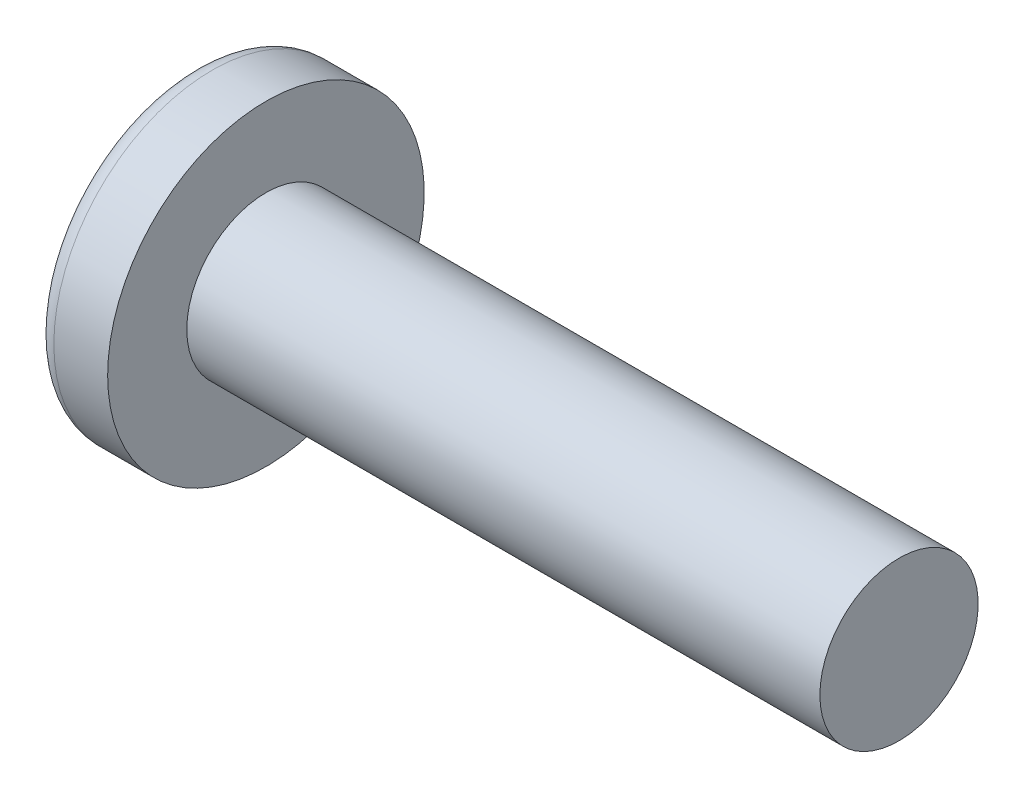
from build123d import *

# Parameters (mm, degrees)
CIRPATTERN1_COUNT = 2
CIRPATTERN1_ANGLE = 90


with BuildPart() as part:
    # BodySke → Base-Revolve (revolve)
    with BuildSketch(Plane.XY, mode=Mode.PRIVATE) as base_revolve_sk:
        with BuildLine():
            Line((7.5, 5), (7.5, 10))
            Line((7.5, 10), (4.100420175, 10))
            ThreePointArc((4.100420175, 10), (3.560149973, 9.871498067), (3.135589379, 9.513513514))
            ThreePointArc((3.135589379, 9.513513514), (0.804103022, 5.008464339), (0, 0))
            Line((0, 0), (47.5, 0))
            Line((47.5, 0), (47.5, 5))
            Line((47.5, 5), (7.5, 5))
        make_face()
    revolve(base_revolve_sk.sketch.rotate(Axis((-25.4, 0, 0), (1, 0, 0)), 90), axis=Axis((-25.4, 0, 0), (1, 0, 0)))

    # Sketch3 → Cut-Loft1 section 0
    with BuildSketch(Plane(origin=(0, 0, 0), x_dir=(0, 0, -1), z_dir=(1, 0, 0))):
        with BuildLine():
            Line((0.92, -5.09), (-0.92, -5.09))
            Line((-0.92, -5.09), (-0.92, 5.09))
            Line((-0.92, 5.09), (0.92, 5.09))
            Line((0.92, 5.09), (0.92, -5.09))
        make_face()
    # Sketch4 → Cut-Loft1 section 1
    with BuildSketch(Plane(origin=(6.09, 0, 0), x_dir=(0, 0, -1), z_dir=(1, 0, 0))):
        with BuildLine():
            Line((0.46, -0.46), (-0.46, -0.46))
            Line((-0.46, -0.46), (-0.46, 0.46))
            Line((-0.46, 0.46), (0.46, 0.46))
            Line((0.46, 0.46), (0.46, -0.46))
        make_face()
    cut_loft1 = loft(mode=Mode.SUBTRACT)

    # CirPattern1: Cut-Loft1 ×2 about axis
    cirpattern1_axis = Axis((0, 0, 0), (1, 0, 0))
    for i in range(1, CIRPATTERN1_COUNT):
        add(cut_loft1.rotate(cirpattern1_axis, i * CIRPATTERN1_ANGLE / (CIRPATTERN1_COUNT - 1)), mode=Mode.SUBTRACT)


solid = part.part
